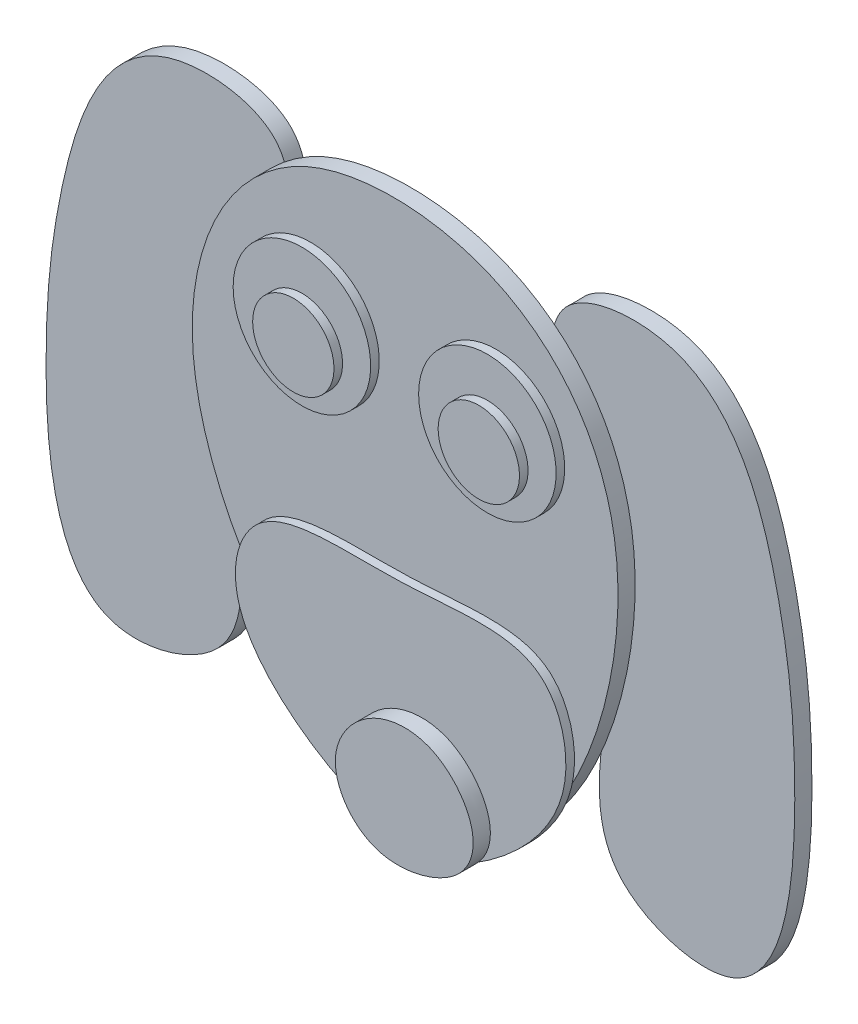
from build123d import *

# Parameters (mm, degrees)
SKETCH1_R             = 25.4
BOSS_EXTRUDE1_DEPTH   = 3.175
BOSS_EXTRUDE3_DEPTH   = 3.175
BOSS_EXTRUDE4_DEPTH   = 3.175
BOSS_EXTRUDE4_2_DEPTH = 3.175
BOSS_EXTRUDE5_START   = 3.175
SKETCH2_4_R           = 12.707760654
BOSS_EXTRUDE5_DEPTH   = 1.5875
BOSS_EXTRUDE5_2_DEPTH = 1.5875
BOSS_EXTRUDE6_START   = 4.7625
SKETCH2_5_R           = 7.512889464
BOSS_EXTRUDE6_DEPTH   = 1.5875
BOSS_EXTRUDE6_2_DEPTH = 1.5875
BOSS_EXTRUDE7_START   = 3.175
BOSS_EXTRUDE7_DEPTH   = 1.5875
BOSS_EXTRUDE8_START   = 4.7625
BOSS_EXTRUDE8_DEPTH   = 3.175


with BuildPart() as part:
    # Sketch1 → Boss-Extrude1 (new body)
    with BuildSketch(Plane.XY):
        Circle(SKETCH1_R)
    extrude(amount=BOSS_EXTRUDE1_DEPTH)

    # Sketch2 → Boss-Extrude3 (add)
    with BuildSketch(Plane.XY.offset(3.175)):
        with BuildLine():
            add(Edge.make_bspline(
                [(10.467378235, 39.106095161), (1.655547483, 41.470618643), (-28.16618148, 41.108411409), (-50.712152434, -7.120361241), (-10.592979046, -61.056538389), (29.835008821, -52.444910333), (49.078275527, 8.563792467), (26.179062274, 34.89009886), (10.467378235, 39.106095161)],
                knots=[0, 0, 0, 0, 0.101862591, 0.291151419, 0.509320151, 0.606012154, 0.818376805, 1, 1, 1, 1], degree=3))
        make_face()
    extrude(amount=BOSS_EXTRUDE3_DEPTH)


with BuildPart() as body_2:
    # Sketch2_3 → Boss-Extrude4 (new body)
    with BuildSketch(Plane.XY.offset(3.175)):
        with BuildLine():
            add(Edge.make_bspline(
                [(-27.595097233, 36.558889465), (-31.589154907, 40.023951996), (-56.538778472, 42.803391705), (-67.027960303, 10.36765645), (-70.251279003, -20.089519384), (-67.350557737, -62.941083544), (-29.90488321, -52.129304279), (-34.387816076, -26.418365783), (-38.079643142, 9.708799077), (-21.861974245, 22.366491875), (-25.061192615, 34.360589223), (-27.595097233, 36.558889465)],
                knots=[0, 0, 0, 0, 0.076659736, 0.234655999, 0.351216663, 0.510409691, 0.60021941, 0.722886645, 0.819262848, 0.951365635, 1, 1, 1, 1], degree=3))
        make_face()
    extrude(amount=-BOSS_EXTRUDE4_DEPTH)


with BuildPart() as body_3:
    # Sketch2_3 → Boss-Extrude4 2 (new body)
    with BuildSketch(Plane.XY.offset(3.175)):
        with BuildLine():
            add(Edge.make_bspline(
                [(27.595097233, 36.558889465), (31.589154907, 40.023951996), (56.538778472, 42.803391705), (67.027960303, 10.36765645), (70.251279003, -20.089519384), (67.350557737, -62.941083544), (29.90488321, -52.129304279), (34.387816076, -26.418365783), (38.079643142, 9.708799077), (21.861974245, 22.366491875), (25.061192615, 34.360589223), (27.595097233, 36.558889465)],
                knots=[0, 0, 0, 0, 0.076659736, 0.234655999, 0.351216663, 0.510409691, 0.60021941, 0.722886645, 0.819262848, 0.951365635, 1, 1, 1, 1], degree=3))
        make_face()
    extrude(amount=-BOSS_EXTRUDE4_2_DEPTH)


with BuildPart() as body_4:
    # Sketch2_4 → Boss-Extrude5 (new body)
    with BuildSketch(Plane.XY.offset(3.175).offset(BOSS_EXTRUDE5_START)):
        with Locations(Location((-17.138690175, 13.144413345, 0), (0, 0, 180))):
            Circle(SKETCH2_4_R)
    extrude(amount=BOSS_EXTRUDE5_DEPTH)


with BuildPart() as body_5:
    # Sketch2_4 → Boss-Extrude5 2 (new body)
    with BuildSketch(Plane.XY.offset(3.175).offset(BOSS_EXTRUDE5_START)):
        with Locations(Location((17.138690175, 13.144413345, 0), (0, 0, 180))):
            Circle(SKETCH2_4_R)
    extrude(amount=BOSS_EXTRUDE5_2_DEPTH)


with BuildPart() as body_6:
    # Sketch2_5 → Boss-Extrude6 (new body)
    with BuildSketch(Plane.XY.offset(3.175).offset(BOSS_EXTRUDE6_START)):
        with Locations(Location((-17.138690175, 10.95716403, 0), (0, 0, 180))):
            Circle(SKETCH2_5_R)
    extrude(amount=BOSS_EXTRUDE6_DEPTH)


with BuildPart() as body_7:
    # Sketch2_5 → Boss-Extrude6 2 (new body)
    with BuildSketch(Plane.XY.offset(3.175).offset(BOSS_EXTRUDE6_START)):
        with Locations(Location((17.138690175, 10.95716403, 0), (0, 0, 180))):
            Circle(SKETCH2_5_R)
    extrude(amount=BOSS_EXTRUDE6_2_DEPTH)


with BuildPart() as body_8:
    # Sketch2_6 → Boss-Extrude7 (new body)
    with BuildSketch(Plane.XY.offset(3.175).offset(BOSS_EXTRUDE7_START)):
        with BuildLine():
            add(Edge.make_bspline(
                [(1.731778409, -18.571339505), (-8.802546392, -18.979663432), (-26.503846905, -16.685840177), (-33.56546047, -42.608219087), (-0.716408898, -63.656170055), (17.397523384, -56.815943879), (34.751430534, -39.588707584), (28.417887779, -15.014561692), (11.426756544, -18.195549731), (1.731778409, -18.571339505)],
                knots=[0, 0, 0, 0, 0.155426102, 0.267105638, 0.464866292, 0.593360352, 0.754333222, 0.856957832, 1, 1, 1, 1], degree=3))
        make_face()
    extrude(amount=BOSS_EXTRUDE7_DEPTH)


with BuildPart() as body_9:
    # Sketch2_7 → Boss-Extrude8 (new body)
    with BuildSketch(Plane.XY.offset(3.175).offset(BOSS_EXTRUDE8_START)):
        with BuildLine():
            add(Edge.make_bspline(
                [(9.451315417, -39.20166601), (6.018251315, -37.84221873), (-2.381912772, -38.580345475), (-10.823915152, -50.391162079), (-1.647584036, -63.40437502), (16.798225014, -58.708977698), (19.305533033, -47.574549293), (12.839529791, -40.543353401), (9.451315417, -39.20166601)],
                knots=[0, 0, 0, 0, 0.147508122, 0.304736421, 0.494752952, 0.660366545, 0.854418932, 1, 1, 1, 1], degree=3))
        make_face()
    extrude(amount=BOSS_EXTRUDE8_DEPTH)


solid = Compound([part.part, body_2.part, body_3.part, body_4.part, body_5.part, body_6.part, body_7.part, body_8.part, body_9.part])
